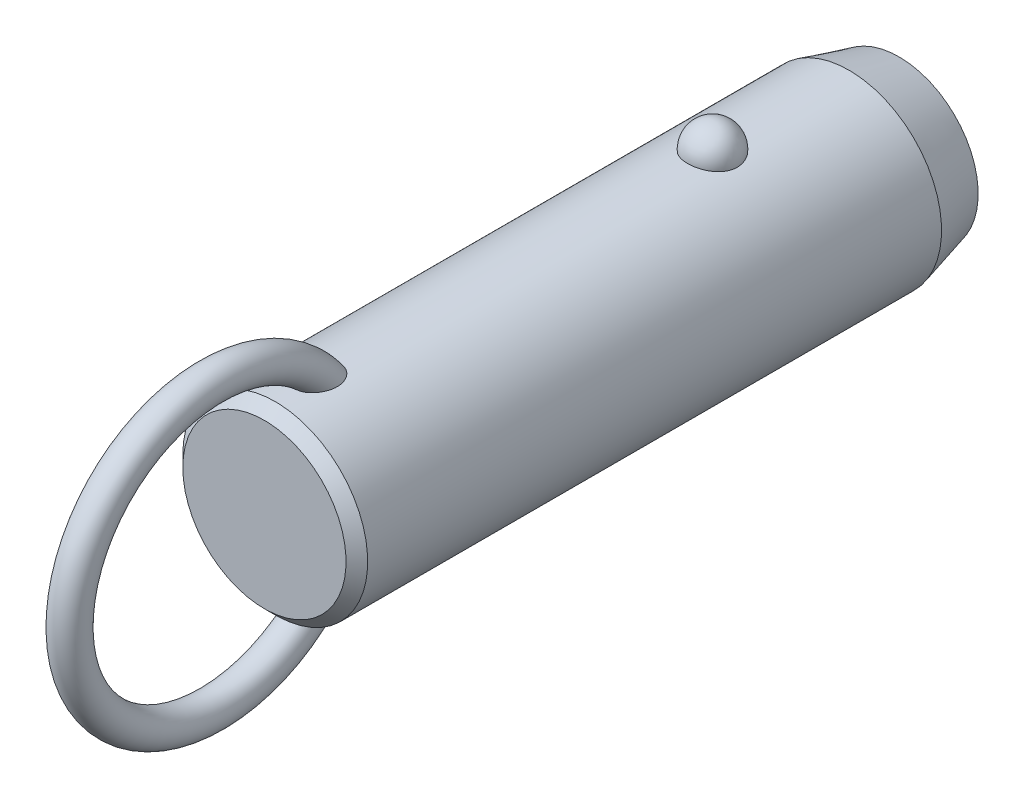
ISO-10303-21;
HEADER;
FILE_DESCRIPTION(('STEP AP214'),'2;1');
FILE_NAME('part.step','',(''),(''),'','','');
FILE_SCHEMA(('AUTOMOTIVE_DESIGN { 1 0 10303 214 1 1 1 1 }'));
ENDSEC;
DATA;
#1=APPLICATION_CONTEXT('core data for automotive mechanical design processes');
#2=APPLICATION_PROTOCOL_DEFINITION('international standard','automotive_design',2000,#1);
#3=PRODUCT_CONTEXT('',#1,'mechanical');
#4=PRODUCT('Part','Part','',(#3));
#5=PRODUCT_RELATED_PRODUCT_CATEGORY('part','',(#4));
#6=PRODUCT_DEFINITION_FORMATION('','',#4);
#7=PRODUCT_DEFINITION_CONTEXT('part definition',#1,'design');
#8=PRODUCT_DEFINITION('design','',#6,#7);
#9=PRODUCT_DEFINITION_SHAPE('','',#8);
#10=(LENGTH_UNIT() NAMED_UNIT(*) SI_UNIT(.MILLI.,.METRE.));
#11=(NAMED_UNIT(*) PLANE_ANGLE_UNIT() SI_UNIT($,.RADIAN.));
#12=(NAMED_UNIT(*) SI_UNIT($,.STERADIAN.) SOLID_ANGLE_UNIT());
#13=UNCERTAINTY_MEASURE_WITH_UNIT(LENGTH_MEASURE(1.E-05),#10,'distance_accuracy_value','');
#14=(GEOMETRIC_REPRESENTATION_CONTEXT(3) GLOBAL_UNCERTAINTY_ASSIGNED_CONTEXT((#13)) GLOBAL_UNIT_ASSIGNED_CONTEXT((#10,
#11,#12)) REPRESENTATION_CONTEXT('',''));
#15=CARTESIAN_POINT('',(0.,0.,0.));
#16=DIRECTION('',(0.,0.,1.));
#17=DIRECTION('',(1.,0.,0.));
#18=AXIS2_PLACEMENT_3D('',#15,#16,#17);
#19=CARTESIAN_POINT('',(0.,0.,38.1));
#20=DIRECTION('',(0.,0.,-1.));
#21=DIRECTION('',(-1.,0.,0.));
#22=AXIS2_PLACEMENT_3D('',#19,#20,#21);
#23=CYLINDRICAL_SURFACE('',#22,11.1);
#24=CARTESIAN_POINT('',(2.9724815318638,10.6945945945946,-3.));
#25=CARTESIAN_POINT('',(2.97247830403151,10.6945972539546,-2.83225059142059));
#26=CARTESIAN_POINT('',(2.95876598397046,10.6984356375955,-2.6644597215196));
#27=CARTESIAN_POINT('',(2.90424529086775,10.7133624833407,-2.33362381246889));
#28=CARTESIAN_POINT('',(2.8634252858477,10.7244540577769,-2.1705808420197));
#29=CARTESIAN_POINT('',(2.75573657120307,10.7526272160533,-1.85396767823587));
#30=CARTESIAN_POINT('',(2.68887937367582,10.7697061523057,-1.70039333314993));
#31=CARTESIAN_POINT('',(2.53079696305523,10.8079438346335,-1.40691598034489));
#32=CARTESIAN_POINT('',(2.43957264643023,10.8291024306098,-1.2670124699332));
#33=CARTESIAN_POINT('',(2.23458150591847,10.8732541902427,-1.00409565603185));
#34=CARTESIAN_POINT('',(2.12071295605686,10.8962553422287,-0.881162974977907));
#35=CARTESIAN_POINT('',(1.87365402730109,10.9414421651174,-0.656352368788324));
#36=CARTESIAN_POINT('',(1.74046358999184,10.9636278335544,-0.554474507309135));
#37=CARTESIAN_POINT('',(1.45872188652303,11.0046495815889,-0.374872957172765));
#38=CARTESIAN_POINT('',(1.31021276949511,11.0234944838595,-0.297085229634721));
#39=CARTESIAN_POINT('',(1.00170030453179,11.0557957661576,-0.167529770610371));
#40=CARTESIAN_POINT('',(0.841698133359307,11.0692526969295,-0.115759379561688));
#41=CARTESIAN_POINT('',(0.517607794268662,11.0890932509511,-0.0403925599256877));
#42=CARTESIAN_POINT('',(0.353633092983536,11.0955916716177,-0.0163383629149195));
#43=CARTESIAN_POINT('',(0.0238420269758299,11.1011989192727,0.00445177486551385));
#44=CARTESIAN_POINT('',(-0.141974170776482,11.1003084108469,0.00119017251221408));
#45=CARTESIAN_POINT('',(-0.468405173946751,11.0912990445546,-0.0323233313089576));
#46=CARTESIAN_POINT('',(-0.629059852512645,11.0832767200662,-0.062214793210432));
#47=CARTESIAN_POINT('',(-0.942937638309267,11.0609962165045,-0.147645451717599));
#48=CARTESIAN_POINT('',(-1.09616062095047,11.0467379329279,-0.203185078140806));
#49=CARTESIAN_POINT('',(-1.39181061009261,11.0134071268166,-0.338752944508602));
#50=CARTESIAN_POINT('',(-1.53417383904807,10.9943086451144,-0.418913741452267));
#51=CARTESIAN_POINT('',(-1.80342160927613,10.9533667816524,-0.601448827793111));
#52=CARTESIAN_POINT('',(-1.9303046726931,10.9315231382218,-0.703825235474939));
#53=CARTESIAN_POINT('',(-2.16747598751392,10.887005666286,-0.930091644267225));
#54=CARTESIAN_POINT('',(-2.27742774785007,10.8643239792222,-1.05433291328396));
#55=CARTESIAN_POINT('',(-2.47517316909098,10.8209886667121,-1.31966633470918));
#56=CARTESIAN_POINT('',(-2.56296538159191,10.8003351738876,-1.46075958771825));
#57=CARTESIAN_POINT('',(-2.71500300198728,10.7631304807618,-1.75753646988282));
#58=CARTESIAN_POINT('',(-2.77898901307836,10.7466250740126,-1.91335887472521));
#59=CARTESIAN_POINT('',(-2.88046189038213,10.7198747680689,-2.2339152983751));
#60=CARTESIAN_POINT('',(-2.91794947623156,10.709629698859,-2.39864907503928));
#61=CARTESIAN_POINT('',(-2.96537819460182,10.6965949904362,-2.73165170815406));
#62=CARTESIAN_POINT('',(-2.97542891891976,10.693775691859,-2.89990378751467));
#63=CARTESIAN_POINT('',(-2.96804271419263,10.6958279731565,-3.235752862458));
#64=CARTESIAN_POINT('',(-2.95060646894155,10.7006993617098,-3.40334987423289));
#65=CARTESIAN_POINT('',(-2.88883358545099,10.71753912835,-3.73233906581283));
#66=CARTESIAN_POINT('',(-2.84462026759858,10.7294749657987,-3.89375610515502));
#67=CARTESIAN_POINT('',(-2.73050447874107,10.7590797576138,-4.20667949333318));
#68=CARTESIAN_POINT('',(-2.66060103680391,10.7767489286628,-4.35818546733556));
#69=CARTESIAN_POINT('',(-2.49642559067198,10.8159599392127,-4.6478542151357));
#70=CARTESIAN_POINT('',(-2.40203047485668,10.8375211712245,-4.78594458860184));
#71=CARTESIAN_POINT('',(-2.19143488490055,10.8820570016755,-5.0441038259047));
#72=CARTESIAN_POINT('',(-2.07523364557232,10.9050316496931,-5.16417205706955));
#73=CARTESIAN_POINT('',(-1.82361254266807,10.9499219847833,-5.38334833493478));
#74=CARTESIAN_POINT('',(-1.68812945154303,10.9718338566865,-5.48238464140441));
#75=CARTESIAN_POINT('',(-1.40191298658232,11.0120611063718,-5.65618873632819));
#76=CARTESIAN_POINT('',(-1.25118062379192,11.0303767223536,-5.73095813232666));
#77=CARTESIAN_POINT('',(-0.940570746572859,11.0611653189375,-5.85334725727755));
#78=CARTESIAN_POINT('',(-0.780821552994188,11.0737044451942,-5.90127578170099));
#79=CARTESIAN_POINT('',(-0.455204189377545,11.0918598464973,-5.96992976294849));
#80=CARTESIAN_POINT('',(-0.289336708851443,11.0974768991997,-5.99065827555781));
#81=CARTESIAN_POINT('',(0.0406846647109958,11.1011307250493,-6.00418773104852));
#82=CARTESIAN_POINT('',(0.204817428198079,11.099299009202,-5.99747318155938));
#83=CARTESIAN_POINT('',(0.529553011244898,11.088551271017,-5.9574031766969));
#84=CARTESIAN_POINT('',(0.690155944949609,11.0796354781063,-5.92404858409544));
#85=CARTESIAN_POINT('',(1.0027760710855,11.0557204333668,-5.83180084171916));
#86=CARTESIAN_POINT('',(1.15482001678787,11.0407414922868,-5.77299291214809));
#87=CARTESIAN_POINT('',(1.44678373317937,11.0062913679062,-5.63147366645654));
#88=CARTESIAN_POINT('',(1.58670279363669,10.9868199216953,-5.54876095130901));
#89=CARTESIAN_POINT('',(1.8527023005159,10.9451315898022,-5.36027644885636));
#90=CARTESIAN_POINT('',(1.97855158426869,10.9228788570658,-5.25418644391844));
#91=CARTESIAN_POINT('',(2.21080872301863,10.8782509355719,-5.02251354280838));
#92=CARTESIAN_POINT('',(2.31721312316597,10.8558757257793,-4.89692718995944));
#93=CARTESIAN_POINT('',(2.5094551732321,10.8130715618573,-4.62745408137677));
#94=CARTESIAN_POINT('',(2.59493284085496,10.7926798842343,-4.48330448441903));
#95=CARTESIAN_POINT('',(2.740862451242,10.7565495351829,-4.18236358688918));
#96=CARTESIAN_POINT('',(2.80132490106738,10.7408089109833,-4.02557762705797));
#97=CARTESIAN_POINT('',(2.88959070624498,10.7173718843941,-3.72475308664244));
#98=CARTESIAN_POINT('',(2.92062102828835,10.7088950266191,-3.58171216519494));
#99=CARTESIAN_POINT('',(2.96206765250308,10.6975052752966,-3.29245795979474));
#100=CARTESIAN_POINT('',(2.97248434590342,10.6945922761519,-3.14624473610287));
#101=CARTESIAN_POINT('',(2.9724815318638,10.6945945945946,-3.));
#102=B_SPLINE_CURVE_WITH_KNOTS('',3,(#24,#25,#26,#27,#28,#29,#30,#31,#32,#33,#34,#35,#36,#37,
#38,#39,#40,#41,#42,#43,#44,#45,#46,#47,#48,#49,#50,#51,#52,#53,#54,#55,#56,#57,#58,#59,#60,#61,
#62,#63,#64,#65,#66,#67,#68,#69,#70,#71,#72,#73,#74,#75,#76,#77,#78,#79,#80,#81,#82,#83,#84,#85,
#86,#87,#88,#89,#90,#91,#92,#93,#94,#95,#96,#97,#98,#99,#100,#101),.UNSPECIFIED.,.T.,.F.,(4,2,2,
2,2,2,2,2,2,2,2,2,2,2,2,2,2,2,2,2,2,2,2,2,2,2,2,2,2,2,2,2,2,2,2,2,2,2,4),(0.,0.502722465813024,
1.00566079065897,1.5083769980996,2.01107471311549,2.51608392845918,3.02109467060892,
3.52475118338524,4.02835620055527,4.523518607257,5.0186364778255,5.50715297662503,
5.9956776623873,6.48688002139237,6.97812923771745,7.47814366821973,7.9781907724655,
8.48353712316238,8.9888697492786,9.49218093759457,9.99547960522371,10.4964777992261,
10.997494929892,11.5010810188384,12.0046847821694,12.5099796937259,13.0152411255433,
13.5145635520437,14.0138298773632,14.5043200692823,14.9947943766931,15.4836390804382,
15.9725123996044,16.4685040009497,16.9645836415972,17.4686765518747,17.972557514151,
18.410841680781,18.849117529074),.UNSPECIFIED.);
#103=CARTESIAN_POINT('',(2.9724815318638,10.6945945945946,-3.));
#104=VERTEX_POINT('',#103);
#105=EDGE_CURVE('E41',#104,#104,#102,.T.);
#106=ORIENTED_EDGE('',*,*,#105,.T.);
#107=EDGE_LOOP('',(#106));
#108=FACE_BOUND('',#107,.T.);
#109=CARTESIAN_POINT('',(0.,0.,49.5000000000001));
#110=DIRECTION('',(0.,0.,1.));
#111=DIRECTION('',(1.,0.,0.));
#112=AXIS2_PLACEMENT_3D('',#109,#110,#111);
#113=CIRCLE('',#112,11.1);
#114=CARTESIAN_POINT('',(-11.1,0.,49.5000000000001));
#115=VERTEX_POINT('',#114);
#116=EDGE_CURVE('E10',#115,#115,#113,.F.);
#117=ORIENTED_EDGE('',*,*,#116,.T.);
#118=EDGE_LOOP('',(#117));
#119=FACE_BOUND('',#118,.T.);
#120=CARTESIAN_POINT('',(-0.564520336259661,-11.0856356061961,41.7578154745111));
#121=CARTESIAN_POINT('',(-0.667202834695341,-11.0804062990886,41.7912839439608));
#122=CARTESIAN_POINT('',(-0.766875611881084,-11.0738877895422,41.8338357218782));
#123=CARTESIAN_POINT('',(-0.957284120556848,-11.0590576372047,41.9354190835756));
#124=CARTESIAN_POINT('',(-1.04801616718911,-11.0507452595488,41.9944574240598));
#125=CARTESIAN_POINT('',(-1.21800952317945,-11.0333016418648,42.1265293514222));
#126=CARTESIAN_POINT('',(-1.29730805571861,-11.0241732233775,42.1995156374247));
#127=CARTESIAN_POINT('',(-1.44337665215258,-11.0060026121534,42.3570374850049));
#128=CARTESIAN_POINT('',(-1.51014622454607,-10.9969604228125,42.4415734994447));
#129=CARTESIAN_POINT('',(-1.63454620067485,-10.9791841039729,42.6255213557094));
#130=CARTESIAN_POINT('',(-1.69127003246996,-10.9705107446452,42.7255493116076));
#131=CARTESIAN_POINT('',(-1.78980785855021,-10.9548648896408,42.9327902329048));
#132=CARTESIAN_POINT('',(-1.83161214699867,-10.9478935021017,43.0400078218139));
#133=CARTESIAN_POINT('',(-1.91557028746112,-10.9335803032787,43.3054080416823));
#134=CARTESIAN_POINT('',(-1.95040620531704,-10.9273269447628,43.4659806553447));
#135=CARTESIAN_POINT('',(-1.99388326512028,-10.9194709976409,43.7906977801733));
#136=CARTESIAN_POINT('',(-2.00248051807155,-10.9178762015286,43.9548478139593));
#137=CARTESIAN_POINT('',(-1.99551615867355,-10.9191578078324,44.3246504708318));
#138=CARTESIAN_POINT('',(-1.9732206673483,-10.9232807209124,44.5301911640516));
#139=CARTESIAN_POINT('',(-1.9152976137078,-10.9335244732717,44.833595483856));
#140=CARTESIAN_POINT('',(-1.89184575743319,-10.9376266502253,44.9340883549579));
#141=CARTESIAN_POINT('',(-1.83700674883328,-10.9469720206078,45.132855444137));
#142=CARTESIAN_POINT('',(-1.80562070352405,-10.9522150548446,45.2311299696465));
#143=CARTESIAN_POINT('',(-1.73463055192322,-10.9636837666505,45.4259148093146));
#144=CARTESIAN_POINT('',(-1.69493416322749,-10.9699202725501,45.5223907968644));
#145=CARTESIAN_POINT('',(-1.60745141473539,-10.9830806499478,45.7116262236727));
#146=CARTESIAN_POINT('',(-1.55966150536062,-10.9900048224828,45.8043840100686));
#147=CARTESIAN_POINT('',(-1.45591812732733,-11.0042280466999,45.9846907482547));
#148=CARTESIAN_POINT('',(-1.40000013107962,-11.0115253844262,46.0722601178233));
#149=CARTESIAN_POINT('',(-1.27937470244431,-11.0261911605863,46.241029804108));
#150=CARTESIAN_POINT('',(-1.21467835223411,-11.0335594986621,46.3222379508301));
#151=CARTESIAN_POINT('',(-1.08218150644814,-11.0473027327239,46.4690010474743));
#152=CARTESIAN_POINT('',(-1.01522633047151,-11.0537063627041,46.5353092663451));
#153=CARTESIAN_POINT('',(-0.872952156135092,-11.065850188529,46.6583780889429));
#154=CARTESIAN_POINT('',(-0.797642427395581,-11.0715911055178,46.7151491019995));
#155=CARTESIAN_POINT('',(-0.651396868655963,-11.081071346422,46.8075155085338));
#156=CARTESIAN_POINT('',(-0.581712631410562,-11.0849841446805,46.8450491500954));
#157=CARTESIAN_POINT('',(-0.437066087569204,-11.0916271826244,46.9082594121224));
#158=CARTESIAN_POINT('',(-0.362109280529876,-11.0943586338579,46.9339481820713));
#159=CARTESIAN_POINT('',(-0.207828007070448,-11.0983242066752,46.971117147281));
#160=CARTESIAN_POINT('',(-0.128467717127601,-11.0995432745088,46.9824545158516));
#161=CARTESIAN_POINT('',(0.0309101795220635,-11.1002423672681,46.9889658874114));
#162=CARTESIAN_POINT('',(0.110927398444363,-11.0997233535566,46.9841488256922));
#163=CARTESIAN_POINT('',(0.256406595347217,-11.097240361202,46.9609599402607));
#164=CARTESIAN_POINT('',(0.322235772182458,-11.0955074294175,46.9447543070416));
#165=CARTESIAN_POINT('',(0.450635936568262,-11.0910350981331,46.9026008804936));
#166=CARTESIAN_POINT('',(0.513205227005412,-11.0882951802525,46.8766480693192));
#167=CARTESIAN_POINT('',(0.662626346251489,-11.0805620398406,46.8026073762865));
#168=CARTESIAN_POINT('',(0.747127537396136,-11.0751144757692,46.7498452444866));
#169=CARTESIAN_POINT('',(0.906756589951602,-11.0631932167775,46.6317206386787));
#170=CARTESIAN_POINT('',(0.981859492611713,-11.0567168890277,46.5663257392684));
#171=CARTESIAN_POINT('',(1.1071220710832,-11.0447856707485,46.4422633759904));
#172=CARTESIAN_POINT('',(1.15909566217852,-11.0394280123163,46.3853831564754));
#173=CARTESIAN_POINT('',(1.25791923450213,-11.0286040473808,46.2673271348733));
#174=CARTESIAN_POINT('',(1.30476642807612,-11.0231376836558,46.2061490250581));
#175=CARTESIAN_POINT('',(1.43818612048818,-11.0068027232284,46.017305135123));
#176=CARTESIAN_POINT('',(1.51751767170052,-10.9960104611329,45.8844531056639));
#177=CARTESIAN_POINT('',(1.63597546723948,-10.9788847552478,45.6531371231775));
#178=CARTESIAN_POINT('',(1.67988876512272,-10.9722190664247,45.5570530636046));
#179=CARTESIAN_POINT('',(1.75953241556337,-10.9597298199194,45.3614311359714));
#180=CARTESIAN_POINT('',(1.79525967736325,-10.9539065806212,45.2618919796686));
#181=CARTESIAN_POINT('',(1.85844731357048,-10.9433632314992,45.0602111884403));
#182=CARTESIAN_POINT('',(1.88591073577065,-10.9386427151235,44.9580705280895));
#183=CARTESIAN_POINT('',(1.93234324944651,-10.9305350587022,44.751819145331));
#184=CARTESIAN_POINT('',(1.95131065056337,-10.9271481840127,44.6477080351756));
#185=CARTESIAN_POINT('',(1.99040203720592,-10.9201183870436,44.3654588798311));
#186=CARTESIAN_POINT('',(2.00221217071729,-10.9179256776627,44.1860370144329));
#187=CARTESIAN_POINT('',(1.99711676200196,-10.9188636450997,43.8277133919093));
#188=CARTESIAN_POINT('',(1.98026150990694,-10.9219849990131,43.6488112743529));
#189=CARTESIAN_POINT('',(1.92151657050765,-10.9324473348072,43.3364514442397));
#190=CARTESIAN_POINT('',(1.88605081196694,-10.9386915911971,43.2017594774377));
#191=CARTESIAN_POINT('',(1.79393020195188,-10.9541780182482,42.9399669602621));
#192=CARTESIAN_POINT('',(1.73729868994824,-10.9634168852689,42.8128582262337));
#193=CARTESIAN_POINT('',(1.61237037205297,-10.9824218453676,42.5894184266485));
#194=CARTESIAN_POINT('',(1.54715374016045,-10.9918945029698,42.4913455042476));
#195=CARTESIAN_POINT('',(1.40127026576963,-11.0114415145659,42.3074341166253));
#196=CARTESIAN_POINT('',(1.32060742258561,-11.0215157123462,42.2215924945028));
#197=CARTESIAN_POINT('',(1.14474787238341,-11.041168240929,42.0651630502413));
#198=CARTESIAN_POINT('',(1.04947805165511,-11.0507437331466,41.9946565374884));
#199=CARTESIAN_POINT('',(0.847278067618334,-11.0680789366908,41.872640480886));
#200=CARTESIAN_POINT('',(0.740351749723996,-11.0758392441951,41.8211246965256));
#201=CARTESIAN_POINT('',(0.529289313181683,-11.0878275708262,41.7434852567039));
#202=CARTESIAN_POINT('',(0.425895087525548,-11.0923259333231,41.715377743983));
#203=CARTESIAN_POINT('',(0.215723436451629,-11.0984001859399,41.6777038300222));
#204=CARTESIAN_POINT('',(0.108947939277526,-11.0999777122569,41.6681270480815));
#205=CARTESIAN_POINT('',(-0.0938962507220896,-11.1000196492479,41.6678773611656));
#206=CARTESIAN_POINT('',(-0.189967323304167,-11.0987797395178,41.6754089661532));
#207=CARTESIAN_POINT('',(-0.379657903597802,-11.0939111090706,41.7055079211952));
#208=CARTESIAN_POINT('',(-0.473277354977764,-11.0902823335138,41.7280756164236));
#209=CARTESIAN_POINT('',(-0.564520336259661,-11.0856356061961,41.7578154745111));
#210=B_SPLINE_CURVE_WITH_KNOTS('',3,(#120,#121,#122,#123,#124,#125,#126,#127,#128,#129,#130,
#131,#132,#133,#134,#135,#136,#137,#138,#139,#140,#141,#142,#143,#144,#145,#146,#147,#148,#149,
#150,#151,#152,#153,#154,#155,#156,#157,#158,#159,#160,#161,#162,#163,#164,#165,#166,#167,#168,
#169,#170,#171,#172,#173,#174,#175,#176,#177,#178,#179,#180,#181,#182,#183,#184,#185,#186,#187,
#188,#189,#190,#191,#192,#193,#194,#195,#196,#197,#198,#199,#200,#201,#202,#203,#204,#205,#206,
#207,#208,#209),.UNSPECIFIED.,.T.,.F.,(4,2,2,2,2,2,2,2,2,2,2,2,2,2,2,2,2,2,2,2,2,2,2,2,2,2,2,2,
2,2,2,2,2,2,2,2,2,2,2,2,2,2,2,2,4),(0.,0.323999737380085,0.648132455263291,0.97118486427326,
1.29424994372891,1.63886237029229,1.98369857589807,2.47426059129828,2.96564271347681,
3.5825739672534,3.89215258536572,4.20168803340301,4.51486273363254,4.82817514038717,
5.1401591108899,5.45175282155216,5.73442856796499,6.01679375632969,6.25364580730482,
6.49025437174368,6.72919963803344,6.9680127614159,7.17061258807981,7.37331685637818,
7.67094989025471,7.96935728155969,8.20075067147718,8.43226927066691,8.89581623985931,
9.2130653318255,9.53043400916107,9.84768549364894,10.1650000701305,10.70229304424,
11.2386443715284,11.6553390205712,12.0715755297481,12.4245637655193,12.7774607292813,
13.1321855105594,13.4867936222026,13.8068771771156,14.1267813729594,14.4146787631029,
14.7025827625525),.UNSPECIFIED.);
#211=CARTESIAN_POINT('',(-0.564520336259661,-11.0856356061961,41.7578154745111));
#212=VERTEX_POINT('',#211);
#213=EDGE_CURVE('E60',#212,#212,#210,.T.);
#214=ORIENTED_EDGE('',*,*,#213,.T.);
#215=EDGE_LOOP('',(#214));
#216=FACE_BOUND('',#215,.T.);
#217=CARTESIAN_POINT('',(-0.564520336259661,11.0856356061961,41.7578154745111));
#218=CARTESIAN_POINT('',(-0.468542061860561,11.0905203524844,41.7265456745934));
#219=CARTESIAN_POINT('',(-0.369793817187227,11.0942886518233,41.7031576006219));
#220=CARTESIAN_POINT('',(-0.16955579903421,11.0991586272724,41.6730858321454));
#221=CARTESIAN_POINT('',(-0.0680604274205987,11.1002543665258,41.6664393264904));
#222=CARTESIAN_POINT('',(0.134549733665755,11.099646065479,41.6701579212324));
#223=CARTESIAN_POINT('',(0.235664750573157,11.0979441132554,41.6805103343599));
#224=CARTESIAN_POINT('',(0.43463240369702,11.0919342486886,41.7178318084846));
#225=CARTESIAN_POINT('',(0.532486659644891,11.0876276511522,41.7447924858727));
#226=CARTESIAN_POINT('',(0.72244585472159,11.0768742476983,41.8144096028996));
#227=CARTESIAN_POINT('',(0.814543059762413,11.0704246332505,41.8570866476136));
#228=CARTESIAN_POINT('',(0.990565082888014,11.0560659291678,41.9566487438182));
#229=CARTESIAN_POINT('',(1.07448844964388,11.048156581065,42.0135363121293));
#230=CARTESIAN_POINT('',(1.23562672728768,11.0313221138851,42.1422106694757));
#231=CARTESIAN_POINT('',(1.31242684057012,11.0223686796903,42.2145117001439));
#232=CARTESIAN_POINT('',(1.45398030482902,11.0045918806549,42.3700425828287));
#233=CARTESIAN_POINT('',(1.51873073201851,10.9957685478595,42.4532750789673));
#234=CARTESIAN_POINT('',(1.64107232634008,10.9782087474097,42.6363842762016));
#235=CARTESIAN_POINT('',(1.6974317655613,10.9695572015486,42.7370893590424));
#236=CARTESIAN_POINT('',(1.79515063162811,10.9539887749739,42.9456264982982));
#237=CARTESIAN_POINT('',(1.83649966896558,10.9470730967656,43.0534634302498));
#238=CARTESIAN_POINT('',(1.91931148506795,10.9329211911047,43.3203995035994));
#239=CARTESIAN_POINT('',(1.95340104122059,10.9267904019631,43.4818612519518));
#240=CARTESIAN_POINT('',(1.99526195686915,10.9192174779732,43.8082163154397));
#241=CARTESIAN_POINT('',(2.00298989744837,10.9177830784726,43.9731148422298));
#242=CARTESIAN_POINT('',(1.99396251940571,10.9194420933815,44.3441006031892));
#243=CARTESIAN_POINT('',(1.97050829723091,10.923774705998,44.5500387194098));
#244=CARTESIAN_POINT('',(1.91079643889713,10.9343131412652,44.8539019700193));
#245=CARTESIAN_POINT('',(1.8867370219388,10.9385106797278,44.9545296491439));
#246=CARTESIAN_POINT('',(1.83065508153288,10.9480376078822,45.1535107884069));
#247=CARTESIAN_POINT('',(1.79863369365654,10.9533668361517,45.251864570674));
#248=CARTESIAN_POINT('',(1.72633365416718,10.9649954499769,45.4467203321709));
#249=CARTESIAN_POINT('',(1.68596409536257,10.9713053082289,45.5431879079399));
#250=CARTESIAN_POINT('',(1.59707998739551,10.9845964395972,45.7323233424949));
#251=CARTESIAN_POINT('',(1.54856169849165,10.9915780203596,45.8249894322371));
#252=CARTESIAN_POINT('',(1.44330168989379,11.0058935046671,46.0049752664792));
#253=CARTESIAN_POINT('',(1.38659749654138,11.0132257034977,46.092316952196));
#254=CARTESIAN_POINT('',(1.26431158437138,11.0279330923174,46.2604563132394));
#255=CARTESIAN_POINT('',(1.19874160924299,11.0353082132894,46.3412624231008));
#256=CARTESIAN_POINT('',(1.06542088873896,11.048931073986,46.4859856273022));
#257=CARTESIAN_POINT('',(0.998640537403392,11.0552153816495,46.550784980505));
#258=CARTESIAN_POINT('',(0.856896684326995,11.0671032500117,46.6708462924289));
#259=CARTESIAN_POINT('',(0.781942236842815,11.0727075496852,46.7261186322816));
#260=CARTESIAN_POINT('',(0.636276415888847,11.081949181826,46.8159721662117));
#261=CARTESIAN_POINT('',(0.566755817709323,11.0857572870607,46.8524410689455));
#262=CARTESIAN_POINT('',(0.422602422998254,11.0921860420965,46.9135333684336));
#263=CARTESIAN_POINT('',(0.347974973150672,11.0948079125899,46.9381689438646));
#264=CARTESIAN_POINT('',(0.194593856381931,11.0985608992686,46.9733233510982));
#265=CARTESIAN_POINT('',(0.115807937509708,11.0996777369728,46.9837069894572));
#266=CARTESIAN_POINT('',(-0.0422499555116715,11.1002003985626,46.9885747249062));
#267=CARTESIAN_POINT('',(-0.121521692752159,11.09960699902,46.983066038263));
#268=CARTESIAN_POINT('',(-0.266046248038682,11.0970123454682,46.9588271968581));
#269=CARTESIAN_POINT('',(-0.331661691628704,11.0952283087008,46.9421356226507));
#270=CARTESIAN_POINT('',(-0.459588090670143,11.0906663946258,46.8991117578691));
#271=CARTESIAN_POINT('',(-0.521897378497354,11.0878880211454,46.872774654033));
#272=CARTESIAN_POINT('',(-0.671446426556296,11.0800342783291,46.7975130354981));
#273=CARTESIAN_POINT('',(-0.756250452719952,11.0744969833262,46.7438182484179));
#274=CARTESIAN_POINT('',(-0.91634957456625,11.0624045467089,46.6238029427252));
#275=CARTESIAN_POINT('',(-0.991618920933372,11.0558467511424,46.5574493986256));
#276=CARTESIAN_POINT('',(-1.11713140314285,11.0437783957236,46.4316335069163));
#277=CARTESIAN_POINT('',(-1.16920539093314,11.0383619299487,46.3739524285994));
#278=CARTESIAN_POINT('',(-1.26817476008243,11.02743010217,46.2542809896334));
#279=CARTESIAN_POINT('',(-1.315067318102,11.0219146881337,46.1922883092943));
#280=CARTESIAN_POINT('',(-1.40399813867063,11.0109399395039,46.0647843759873));
#281=CARTESIAN_POINT('',(-1.4460286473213,11.0054807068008,45.9992677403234));
#282=CARTESIAN_POINT('',(-1.52538779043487,10.9947621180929,45.8654223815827));
#283=CARTESIAN_POINT('',(-1.56271516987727,10.9895028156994,45.7970929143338));
#284=CARTESIAN_POINT('',(-1.64537943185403,10.9774790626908,45.6332101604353));
#285=CARTESIAN_POINT('',(-1.68879497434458,10.9708503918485,45.5366735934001));
#286=CARTESIAN_POINT('',(-1.76740738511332,10.9584602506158,45.3402369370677));
#287=CARTESIAN_POINT('',(-1.80260120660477,10.95269910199,45.2403356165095));
#288=CARTESIAN_POINT('',(-1.86468657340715,10.9423003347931,45.0379663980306));
#289=CARTESIAN_POINT('',(-1.89158164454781,10.9376622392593,44.9354996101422));
#290=CARTESIAN_POINT('',(-1.93682458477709,10.9297405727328,44.7286429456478));
#291=CARTESIAN_POINT('',(-1.9551708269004,10.9264572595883,44.6242527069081));
#292=CARTESIAN_POINT('',(-1.99232562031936,10.9197647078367,44.3426287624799));
#293=CARTESIAN_POINT('',(-2.00294603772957,10.9177914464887,44.1641857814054));
#294=CARTESIAN_POINT('',(-1.99566675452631,10.9191290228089,43.8079962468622));
#295=CARTESIAN_POINT('',(-1.97781651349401,10.9224306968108,43.6302490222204));
#296=CARTESIAN_POINT('',(-1.91747214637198,10.93315926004,43.3197921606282));
#297=CARTESIAN_POINT('',(-1.88131022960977,10.9395108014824,43.185825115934));
#298=CARTESIAN_POINT('',(-1.7879038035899,10.9551659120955,42.9255975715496));
#299=CARTESIAN_POINT('',(-1.73068309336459,10.9644661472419,42.7993285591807));
#300=CARTESIAN_POINT('',(-1.60475573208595,10.9835398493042,42.5774156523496));
#301=CARTESIAN_POINT('',(-1.53908879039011,10.9930297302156,42.4800265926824));
#302=CARTESIAN_POINT('',(-1.39238608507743,11.0125708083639,42.2975250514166));
#303=CARTESIAN_POINT('',(-1.31135150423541,11.0226219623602,42.2124116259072));
#304=CARTESIAN_POINT('',(-1.14382035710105,11.0411991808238,42.0652994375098));
#305=CARTESIAN_POINT('',(-1.05858500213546,11.0497792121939,42.0018693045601));
#306=CARTESIAN_POINT('',(-0.878723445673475,11.0655285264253,41.8902505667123));
#307=CARTESIAN_POINT('',(-0.784123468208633,11.0727015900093,41.8420208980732));
#308=CARTESIAN_POINT('',(-0.646163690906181,11.0812501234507,41.786023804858));
#309=CARTESIAN_POINT('',(-0.605595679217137,11.0835451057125,41.7711978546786));
#310=CARTESIAN_POINT('',(-0.564520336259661,11.0856356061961,41.7578154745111));
#311=B_SPLINE_CURVE_WITH_KNOTS('',3,(#217,#218,#219,#220,#221,#222,#223,#224,#225,#226,#227,
#228,#229,#230,#231,#232,#233,#234,#235,#236,#237,#238,#239,#240,#241,#242,#243,#244,#245,#246,
#247,#248,#249,#250,#251,#252,#253,#254,#255,#256,#257,#258,#259,#260,#261,#262,#263,#264,#265,
#266,#267,#268,#269,#270,#271,#272,#273,#274,#275,#276,#277,#278,#279,#280,#281,#282,#283,#284,
#285,#286,#287,#288,#289,#290,#291,#292,#293,#294,#295,#296,#297,#298,#299,#300,#301,#302,#303,
#304,#305,#306,#307,#308,#309,#310),.UNSPECIFIED.,.T.,.F.,(4,2,2,2,2,2,2,2,2,2,2,2,2,2,2,2,2,2,
2,2,2,2,2,2,2,2,2,2,2,2,2,2,2,2,2,2,2,2,2,2,2,2,2,2,2,2,4),(0.,0.303061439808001,
0.60679549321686,0.910302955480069,1.21365733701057,1.51741085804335,1.82121821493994,
2.13745205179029,2.45376252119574,2.799586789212,3.14564996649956,3.6383239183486,
4.13180893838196,4.75031912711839,5.06071926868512,5.37107516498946,5.68500772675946,
5.99908475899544,6.31176519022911,6.62403542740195,6.90315673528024,7.18197194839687,
7.41687778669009,7.6515413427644,7.8884158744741,8.12518286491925,8.32752842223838,
8.5299750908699,8.82986421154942,9.13054668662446,9.36393502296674,9.59744991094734,
9.83133221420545,10.0652767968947,10.383032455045,10.7009056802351,11.0186436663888,
11.3364420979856,11.8705925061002,12.4038159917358,12.8189662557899,13.2336487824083,
13.5857049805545,13.9377340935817,14.2561354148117,14.5736690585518,14.7033687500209),.UNSPECIFIED.);
#312=CARTESIAN_POINT('',(-0.564520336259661,11.0856356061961,41.7578154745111));
#313=VERTEX_POINT('',#312);
#314=EDGE_CURVE('E68',#313,#313,#311,.T.);
#315=ORIENTED_EDGE('',*,*,#314,.T.);
#316=EDGE_LOOP('',(#315));
#317=FACE_BOUND('',#316,.T.);
#318=CARTESIAN_POINT('',(0.,0.,-19.4000000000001));
#319=DIRECTION('',(0.,0.,-1.));
#320=DIRECTION('',(-1.,0.,0.));
#321=AXIS2_PLACEMENT_3D('',#318,#319,#320);
#322=CIRCLE('',#321,11.1);
#323=CARTESIAN_POINT('',(-11.1,0.,-19.4000000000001));
#324=VERTEX_POINT('',#323);
#325=EDGE_CURVE('E57',#324,#324,#322,.F.);
#326=ORIENTED_EDGE('',*,*,#325,.T.);
#327=EDGE_LOOP('',(#326));
#328=FACE_BOUND('',#327,.T.);
#329=ADVANCED_FACE('F37',(#108,#119,#216,#317,#328),#23,.T.);
#330=CARTESIAN_POINT('',(0.,0.,-25.4));
#331=DIRECTION('',(0.,0.,-1.));
#332=DIRECTION('',(-1.,0.,0.));
#333=AXIS2_PLACEMENT_3D('',#330,#331,#332);
#334=PLANE('',#333);
#335=CARTESIAN_POINT('',(0.,0.,-25.4));
#336=DIRECTION('',(0.,0.,-1.));
#337=DIRECTION('',(-1.,0.,0.));
#338=AXIS2_PLACEMENT_3D('',#335,#336,#337);
#339=CIRCLE('',#338,9.49230484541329);
#340=CARTESIAN_POINT('',(-9.49230484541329,0.,-25.4));
#341=VERTEX_POINT('',#340);
#342=EDGE_CURVE('E67',#341,#341,#339,.T.);
#343=ORIENTED_EDGE('',*,*,#342,.T.);
#344=EDGE_LOOP('',(#343));
#345=FACE_BOUND('',#344,.T.);
#346=ADVANCED_FACE('F86',(#345),#334,.T.);
#347=CARTESIAN_POINT('',(0.,0.,-25.4));
#348=DIRECTION('',(0.,0.,1.));
#349=DIRECTION('',(1.,0.,0.));
#350=AXIS2_PLACEMENT_3D('',#347,#348,#349);
#351=CONICAL_SURFACE('',#350,9.49230484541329,0.261799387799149);
#352=ORIENTED_EDGE('',*,*,#325,.F.);
#353=EDGE_LOOP('',(#352));
#354=FACE_BOUND('',#353,.T.);
#355=ORIENTED_EDGE('',*,*,#342,.F.);
#356=EDGE_LOOP('',(#355));
#357=FACE_BOUND('',#356,.T.);
#358=ADVANCED_FACE('F84',(#354,#357),#351,.T.);
#359=CARTESIAN_POINT('',(0.,0.,50.8));
#360=DIRECTION('',(0.,0.,1.));
#361=DIRECTION('',(1.,0.,0.));
#362=AXIS2_PLACEMENT_3D('',#359,#360,#361);
#363=PLANE('',#362);
#364=CARTESIAN_POINT('',(0.,0.,50.8));
#365=DIRECTION('',(0.,0.,1.));
#366=DIRECTION('',(1.,0.,0.));
#367=AXIS2_PLACEMENT_3D('',#364,#365,#366);
#368=CIRCLE('',#367,9.80000000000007);
#369=CARTESIAN_POINT('',(-9.80000000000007,0.,50.8));
#370=VERTEX_POINT('',#369);
#371=EDGE_CURVE('E50',#370,#370,#368,.T.);
#372=ORIENTED_EDGE('',*,*,#371,.T.);
#373=EDGE_LOOP('',(#372));
#374=FACE_BOUND('',#373,.T.);
#375=ADVANCED_FACE('F78',(#374),#363,.T.);
#376=CARTESIAN_POINT('',(0.,0.,57.15));
#377=DIRECTION('',(1.,0.,0.));
#378=DIRECTION('',(0.,0.,-1.));
#379=AXIS2_PLACEMENT_3D('',#376,#377,#378);
#380=TOROIDAL_SURFACE('',#379,17.05,2.);
#381=ORIENTED_EDGE('',*,*,#314,.F.);
#382=EDGE_LOOP('',(#381));
#383=FACE_BOUND('',#382,.T.);
#384=ORIENTED_EDGE('',*,*,#213,.F.);
#385=EDGE_LOOP('',(#384));
#386=FACE_BOUND('',#385,.T.);
#387=ADVANCED_FACE('F74',(#383,#386),#380,.T.);
#388=CARTESIAN_POINT('',(0.,0.,50.8));
#389=DIRECTION('',(0.,0.,-1.));
#390=DIRECTION('',(-1.,0.,0.));
#391=AXIS2_PLACEMENT_3D('',#388,#389,#390);
#392=CONICAL_SURFACE('',#391,9.80000000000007,0.785398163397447);
#393=CARTESIAN_POINT('',(-11.1,0.,49.5000000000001));
#394=CARTESIAN_POINT('',(-11.0864583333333,0.,49.5135416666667));
#395=CARTESIAN_POINT('',(-11.0729166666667,0.,49.5270833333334));
#396=CARTESIAN_POINT('',(-11.0458333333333,0.,49.5541666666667));
#397=CARTESIAN_POINT('',(-11.0322916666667,0.,49.5677083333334));
#398=CARTESIAN_POINT('',(-11.0052083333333,0.,49.5947916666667));
#399=CARTESIAN_POINT('',(-10.9916666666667,0.,49.6083333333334));
#400=CARTESIAN_POINT('',(-10.9645833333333,0.,49.6354166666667));
#401=CARTESIAN_POINT('',(-10.9510416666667,0.,49.6489583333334));
#402=CARTESIAN_POINT('',(-10.9239583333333,0.,49.6760416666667));
#403=CARTESIAN_POINT('',(-10.9104166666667,0.,49.6895833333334));
#404=CARTESIAN_POINT('',(-10.8833333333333,0.,49.7166666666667));
#405=CARTESIAN_POINT('',(-10.8697916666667,0.,49.7302083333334));
#406=CARTESIAN_POINT('',(-10.8427083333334,0.,49.7572916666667));
#407=CARTESIAN_POINT('',(-10.8291666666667,0.,49.7708333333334));
#408=CARTESIAN_POINT('',(-10.8020833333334,0.,49.7979166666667));
#409=CARTESIAN_POINT('',(-10.7885416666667,0.,49.8114583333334));
#410=CARTESIAN_POINT('',(-10.7614583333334,0.,49.8385416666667));
#411=CARTESIAN_POINT('',(-10.7479166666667,0.,49.8520833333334));
#412=CARTESIAN_POINT('',(-10.7208333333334,0.,49.8791666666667));
#413=CARTESIAN_POINT('',(-10.7072916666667,0.,49.8927083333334));
#414=CARTESIAN_POINT('',(-10.6802083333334,0.,49.9197916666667));
#415=CARTESIAN_POINT('',(-10.6666666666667,0.,49.9333333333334));
#416=CARTESIAN_POINT('',(-10.6395833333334,0.,49.9604166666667));
#417=CARTESIAN_POINT('',(-10.6260416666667,0.,49.9739583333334));
#418=CARTESIAN_POINT('',(-10.5989583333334,0.,50.0010416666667));
#419=CARTESIAN_POINT('',(-10.5854166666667,0.,50.0145833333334));
#420=CARTESIAN_POINT('',(-10.5583333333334,0.,50.0416666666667));
#421=CARTESIAN_POINT('',(-10.5447916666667,0.,50.0552083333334));
#422=CARTESIAN_POINT('',(-10.5177083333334,0.,50.0822916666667));
#423=CARTESIAN_POINT('',(-10.5041666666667,0.,50.0958333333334));
#424=CARTESIAN_POINT('',(-10.4770833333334,0.,50.1229166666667));
#425=CARTESIAN_POINT('',(-10.4635416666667,0.,50.1364583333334));
#426=CARTESIAN_POINT('',(-10.4364583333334,0.,50.1635416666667));
#427=CARTESIAN_POINT('',(-10.4229166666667,0.,50.1770833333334));
#428=CARTESIAN_POINT('',(-10.3958333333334,0.,50.2041666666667));
#429=CARTESIAN_POINT('',(-10.3822916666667,0.,50.2177083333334));
#430=CARTESIAN_POINT('',(-10.3552083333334,0.,50.2447916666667));
#431=CARTESIAN_POINT('',(-10.3416666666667,0.,50.2583333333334));
#432=CARTESIAN_POINT('',(-10.3145833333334,0.,50.2854166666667));
#433=CARTESIAN_POINT('',(-10.3010416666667,0.,50.2989583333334));
#434=CARTESIAN_POINT('',(-10.2739583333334,0.,50.3260416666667));
#435=CARTESIAN_POINT('',(-10.2604166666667,0.,50.3395833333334));
#436=CARTESIAN_POINT('',(-10.2333333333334,0.,50.3666666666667));
#437=CARTESIAN_POINT('',(-10.2197916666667,0.,50.3802083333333));
#438=CARTESIAN_POINT('',(-10.1927083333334,0.,50.4072916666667));
#439=CARTESIAN_POINT('',(-10.1791666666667,0.,50.4208333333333));
#440=CARTESIAN_POINT('',(-10.1520833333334,0.,50.4479166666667));
#441=CARTESIAN_POINT('',(-10.1385416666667,0.,50.4614583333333));
#442=CARTESIAN_POINT('',(-10.1114583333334,0.,50.4885416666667));
#443=CARTESIAN_POINT('',(-10.0979166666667,0.,50.5020833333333));
#444=CARTESIAN_POINT('',(-10.0708333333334,0.,50.5291666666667));
#445=CARTESIAN_POINT('',(-10.0572916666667,0.,50.5427083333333));
#446=CARTESIAN_POINT('',(-10.0302083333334,0.,50.5697916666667));
#447=CARTESIAN_POINT('',(-10.0166666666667,0.,50.5833333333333));
#448=CARTESIAN_POINT('',(-9.9895833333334,0.,50.6104166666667));
#449=CARTESIAN_POINT('',(-9.97604166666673,0.,50.6239583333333));
#450=CARTESIAN_POINT('',(-9.9489583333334,0.,50.6510416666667));
#451=CARTESIAN_POINT('',(-9.93541666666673,0.,50.6645833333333));
#452=CARTESIAN_POINT('',(-9.9083333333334,0.,50.6916666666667));
#453=CARTESIAN_POINT('',(-9.89479166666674,0.,50.7052083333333));
#454=CARTESIAN_POINT('',(-9.86770833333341,0.,50.7322916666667));
#455=CARTESIAN_POINT('',(-9.85416666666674,0.,50.7458333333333));
#456=CARTESIAN_POINT('',(-9.82708333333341,0.,50.7729166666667));
#457=CARTESIAN_POINT('',(-9.81354166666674,0.,50.7864583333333));
#458=CARTESIAN_POINT('',(-9.80000000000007,0.,50.8));
#459=B_SPLINE_CURVE_WITH_KNOTS('',3,(#393,#394,#395,#396,#397,#398,#399,#400,#401,#402,#403,
#404,#405,#406,#407,#408,#409,#410,#411,#412,#413,#414,#415,#416,#417,#418,#419,#420,#421,#422,
#423,#424,#425,#426,#427,#428,#429,#430,#431,#432,#433,#434,#435,#436,#437,#438,#439,#440,#441,
#442,#443,#444,#445,#446,#447,#448,#449,#450,#451,#452,#453,#454,#455,#456,#457,#458),
.UNSPECIFIED.,.F.,.F.,(4,2,2,2,2,2,2,2,2,2,2,2,2,2,2,2,2,2,2,2,2,2,2,2,2,2,2,2,2,2,2,2,4),(0.,
0.0574524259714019,0.114904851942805,0.172357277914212,0.229809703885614,0.287262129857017,
0.344714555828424,0.402166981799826,0.459619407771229,0.517071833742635,0.574524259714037,
0.631976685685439,0.689429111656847,0.746881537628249,0.804333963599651,0.861786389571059,
0.919238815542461,0.976691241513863,1.03414366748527,1.09159609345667,1.14904851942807,
1.20650094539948,1.26395337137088,1.32140579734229,1.37885822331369,1.4363106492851,
1.4937630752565,1.55121550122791,1.60866792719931,1.66612035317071,1.72357277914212,
1.78102520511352,1.83847763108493),.UNSPECIFIED.);
#460=EDGE_CURVE('BSEAM39',#115,#370,#459,.T.);
#461=ORIENTED_EDGE('',*,*,#116,.F.);
#462=ORIENTED_EDGE('',*,*,#371,.F.);
#463=ORIENTED_EDGE('',*,*,#460,.T.);
#464=ORIENTED_EDGE('',*,*,#460,.F.);
#465=EDGE_LOOP('',(#461,#463,#462,#464));
#466=FACE_BOUND('',#465,.T.);
#467=ADVANCED_FACE('F39',(#466),#392,.T.);
#468=CARTESIAN_POINT('',(0.,11.1,-3.));
#469=DIRECTION('',(0.,1.,0.));
#470=DIRECTION('',(0.,0.,-1.));
#471=AXIS2_PLACEMENT_3D('',#468,#469,#470);
#472=SPHERICAL_SURFACE('',#471,3.);
#473=ORIENTED_EDGE('',*,*,#105,.F.);
#474=EDGE_LOOP('',(#473));
#475=FACE_BOUND('',#474,.T.);
#476=ADVANCED_FACE('F80',(#475),#472,.T.);
#477=CLOSED_SHELL('',(#329,#346,#358,#375,#387,#467,#476));
#478=MANIFOLD_SOLID_BREP('B2',#477);
#479=ADVANCED_BREP_SHAPE_REPRESENTATION('',(#18,#478),#14);
#480=SHAPE_DEFINITION_REPRESENTATION(#9,#479);
ENDSEC;
END-ISO-10303-21;
